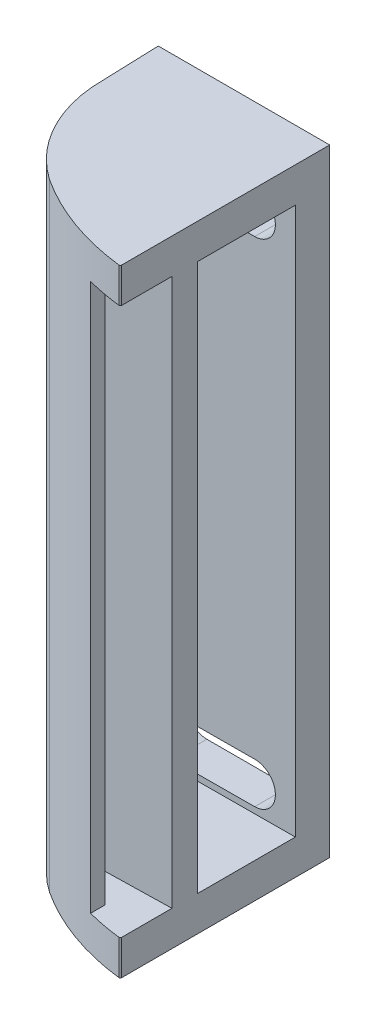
ISO-10303-21;
HEADER;
FILE_DESCRIPTION(('STEP AP214'),'2;1');
FILE_NAME('part.step','',(''),(''),'','','');
FILE_SCHEMA(('AUTOMOTIVE_DESIGN { 1 0 10303 214 1 1 1 1 }'));
ENDSEC;
DATA;
#1=APPLICATION_CONTEXT('core data for automotive mechanical design processes');
#2=APPLICATION_PROTOCOL_DEFINITION('international standard','automotive_design',2000,#1);
#3=PRODUCT_CONTEXT('',#1,'mechanical');
#4=PRODUCT('Part','Part','',(#3));
#5=PRODUCT_RELATED_PRODUCT_CATEGORY('part','',(#4));
#6=PRODUCT_DEFINITION_FORMATION('','',#4);
#7=PRODUCT_DEFINITION_CONTEXT('part definition',#1,'design');
#8=PRODUCT_DEFINITION('design','',#6,#7);
#9=PRODUCT_DEFINITION_SHAPE('','',#8);
#10=(LENGTH_UNIT() NAMED_UNIT(*) SI_UNIT(.MILLI.,.METRE.));
#11=(NAMED_UNIT(*) PLANE_ANGLE_UNIT() SI_UNIT($,.RADIAN.));
#12=(NAMED_UNIT(*) SI_UNIT($,.STERADIAN.) SOLID_ANGLE_UNIT());
#13=UNCERTAINTY_MEASURE_WITH_UNIT(LENGTH_MEASURE(1.E-05),#10,'distance_accuracy_value','');
#14=(GEOMETRIC_REPRESENTATION_CONTEXT(3) GLOBAL_UNCERTAINTY_ASSIGNED_CONTEXT((#13)) GLOBAL_UNIT_ASSIGNED_CONTEXT((#10,
#11,#12)) REPRESENTATION_CONTEXT('',''));
#15=CARTESIAN_POINT('',(0.,0.,0.));
#16=DIRECTION('',(0.,0.,1.));
#17=DIRECTION('',(1.,0.,0.));
#18=AXIS2_PLACEMENT_3D('',#15,#16,#17);
#19=CARTESIAN_POINT('',(-5.301570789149,-9.,5.1214842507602));
#20=DIRECTION('',(0.00523596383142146,0.,0.999986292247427));
#21=DIRECTION('',(0.999986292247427,0.,-0.00523596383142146));
#22=AXIS2_PLACEMENT_3D('',#19,#20,#21);
#23=PLANE('',#22);
#24=CARTESIAN_POINT('',(12.,0.,5.03089261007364));
#25=DIRECTION('',(0.00523596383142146,0.,0.999986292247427));
#26=DIRECTION('',(0.999986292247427,0.,-0.00523596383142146));
#27=AXIS2_PLACEMENT_3D('',#24,#25,#26);
#28=ELLIPSE('',#27,3.00004112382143,3.);
#29=CARTESIAN_POINT('',(12.,3.,5.03089261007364));
#30=VERTEX_POINT('',#29);
#31=CARTESIAN_POINT('',(12.,-3.,5.03089261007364));
#32=VERTEX_POINT('',#31);
#33=EDGE_CURVE('E270',#30,#32,#28,.F.);
#34=ORIENTED_EDGE('',*,*,#33,.T.);
#35=DIRECTION('',(-0.999986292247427,0.,0.00523596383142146));
#36=VECTOR('',#35,1.);
#37=CARTESIAN_POINT('',(-5.301570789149,-3.,5.1214842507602));
#38=LINE('',#37,#36);
#39=CARTESIAN_POINT('',(0.,-3.,5.09372503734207));
#40=VERTEX_POINT('',#39);
#41=EDGE_CURVE('E273',#32,#40,#38,.T.);
#42=ORIENTED_EDGE('',*,*,#41,.T.);
#43=CARTESIAN_POINT('',(0.,0.,5.09372503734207));
#44=DIRECTION('',(0.00523596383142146,0.,0.999986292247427));
#45=DIRECTION('',(0.999986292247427,0.,-0.00523596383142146));
#46=AXIS2_PLACEMENT_3D('',#43,#44,#45);
#47=ELLIPSE('',#46,3.00004112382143,3.);
#48=CARTESIAN_POINT('',(0.,3.,5.09372503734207));
#49=VERTEX_POINT('',#48);
#50=EDGE_CURVE('E264',#40,#49,#47,.F.);
#51=ORIENTED_EDGE('',*,*,#50,.T.);
#52=DIRECTION('',(0.999986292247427,0.,-0.00523596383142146));
#53=VECTOR('',#52,1.);
#54=CARTESIAN_POINT('',(-5.301570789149,3.,5.1214842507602));
#55=LINE('',#54,#53);
#56=EDGE_CURVE('E267',#49,#30,#55,.T.);
#57=ORIENTED_EDGE('',*,*,#56,.T.);
#58=EDGE_LOOP('',(#34,#42,#51,#57));
#59=FACE_BOUND('',#58,.T.);
#60=DIRECTION('',(-0.999986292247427,0.,0.00523596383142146));
#61=VECTOR('',#60,1.);
#62=CARTESIAN_POINT('',(-5.301570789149,-3.9,5.1214842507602));
#63=LINE('',#62,#61);
#64=CARTESIAN_POINT('',(17.9,-3.9,5.));
#65=VERTEX_POINT('',#64);
#66=CARTESIAN_POINT('',(-5.301570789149,-3.9,5.1214842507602));
#67=VERTEX_POINT('',#66);
#68=EDGE_CURVE('E294',#65,#67,#63,.T.);
#69=ORIENTED_EDGE('',*,*,#68,.F.);
#70=DIRECTION('',(0.,1.,0.));
#71=VECTOR('',#70,1.);
#72=CARTESIAN_POINT('',(17.9,-9.,5.));
#73=LINE('',#72,#71);
#74=CARTESIAN_POINT('',(17.9,75.9,5.));
#75=VERTEX_POINT('',#74);
#76=EDGE_CURVE('E401',#65,#75,#73,.T.);
#77=ORIENTED_EDGE('',*,*,#76,.T.);
#78=DIRECTION('',(-0.999986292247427,0.,0.00523596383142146));
#79=VECTOR('',#78,1.);
#80=CARTESIAN_POINT('',(-5.301570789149,75.9,5.1214842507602));
#81=LINE('',#80,#79);
#82=CARTESIAN_POINT('',(-5.301570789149,75.9,5.1214842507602));
#83=VERTEX_POINT('',#82);
#84=EDGE_CURVE('E9',#75,#83,#81,.T.);
#85=ORIENTED_EDGE('',*,*,#84,.T.);
#86=DIRECTION('',(0.,1.,0.));
#87=VECTOR('',#86,1.);
#88=CARTESIAN_POINT('',(-5.301570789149,-9.,5.1214842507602));
#89=LINE('',#88,#87);
#90=EDGE_CURVE('E403',#67,#83,#89,.T.);
#91=ORIENTED_EDGE('',*,*,#90,.F.);
#92=EDGE_LOOP('',(#69,#77,#85,#91));
#93=FACE_BOUND('',#92,.T.);
#94=CARTESIAN_POINT('',(12.,72.,5.03089261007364));
#95=DIRECTION('',(0.00523596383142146,0.,0.999986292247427));
#96=DIRECTION('',(0.999986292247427,0.,-0.00523596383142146));
#97=AXIS2_PLACEMENT_3D('',#94,#95,#96);
#98=ELLIPSE('',#97,3.00004112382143,3.);
#99=CARTESIAN_POINT('',(12.,75.,5.03089261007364));
#100=VERTEX_POINT('',#99);
#101=CARTESIAN_POINT('',(12.,69.,5.03089261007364));
#102=VERTEX_POINT('',#101);
#103=EDGE_CURVE('E237',#100,#102,#98,.F.);
#104=ORIENTED_EDGE('',*,*,#103,.T.);
#105=DIRECTION('',(-0.999986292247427,0.,0.00523596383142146));
#106=VECTOR('',#105,1.);
#107=CARTESIAN_POINT('',(-5.301570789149,69.,5.1214842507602));
#108=LINE('',#107,#106);
#109=CARTESIAN_POINT('',(0.,69.,5.09372503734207));
#110=VERTEX_POINT('',#109);
#111=EDGE_CURVE('E202',#102,#110,#108,.T.);
#112=ORIENTED_EDGE('',*,*,#111,.T.);
#113=CARTESIAN_POINT('',(0.,72.,5.09372503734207));
#114=DIRECTION('',(0.00523596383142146,0.,0.999986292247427));
#115=DIRECTION('',(0.999986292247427,0.,-0.00523596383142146));
#116=AXIS2_PLACEMENT_3D('',#113,#114,#115);
#117=ELLIPSE('',#116,3.00004112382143,3.);
#118=CARTESIAN_POINT('',(0.,75.,5.09372503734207));
#119=VERTEX_POINT('',#118);
#120=EDGE_CURVE('E205',#110,#119,#117,.F.);
#121=ORIENTED_EDGE('',*,*,#120,.T.);
#122=DIRECTION('',(0.999986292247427,0.,-0.00523596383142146));
#123=VECTOR('',#122,1.);
#124=CARTESIAN_POINT('',(-5.301570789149,75.,5.1214842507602));
#125=LINE('',#124,#123);
#126=EDGE_CURVE('E234',#119,#100,#125,.T.);
#127=ORIENTED_EDGE('',*,*,#126,.T.);
#128=EDGE_LOOP('',(#104,#112,#121,#127));
#129=FACE_BOUND('',#128,.T.);
#130=ADVANCED_FACE('F14',(#59,#93,#129),#23,.T.);
#131=CARTESIAN_POINT('',(17.9,-9.,0.));
#132=DIRECTION('',(0.,0.,-1.));
#133=DIRECTION('',(0.,-1.,0.));
#134=AXIS2_PLACEMENT_3D('',#131,#132,#133);
#135=PLANE('',#134);
#136=CARTESIAN_POINT('',(0.,0.,0.));
#137=DIRECTION('',(0.,0.,1.));
#138=DIRECTION('',(1.,0.,0.));
#139=AXIS2_PLACEMENT_3D('',#136,#137,#138);
#140=CIRCLE('',#139,3.);
#141=CARTESIAN_POINT('',(0.,3.,0.));
#142=VERTEX_POINT('',#141);
#143=CARTESIAN_POINT('',(0.,-3.,0.));
#144=VERTEX_POINT('',#143);
#145=EDGE_CURVE('E249',#142,#144,#140,.T.);
#146=ORIENTED_EDGE('',*,*,#145,.T.);
#147=DIRECTION('',(1.,0.,0.));
#148=VECTOR('',#147,1.);
#149=CARTESIAN_POINT('',(0.,-3.,0.));
#150=LINE('',#149,#148);
#151=CARTESIAN_POINT('',(12.,-3.,0.));
#152=VERTEX_POINT('',#151);
#153=EDGE_CURVE('E240',#144,#152,#150,.T.);
#154=ORIENTED_EDGE('',*,*,#153,.T.);
#155=CARTESIAN_POINT('',(12.,0.,0.));
#156=DIRECTION('',(0.,0.,1.));
#157=DIRECTION('',(-1.,0.,0.));
#158=AXIS2_PLACEMENT_3D('',#155,#156,#157);
#159=CIRCLE('',#158,3.);
#160=CARTESIAN_POINT('',(12.,3.,0.));
#161=VERTEX_POINT('',#160);
#162=EDGE_CURVE('E241',#152,#161,#159,.T.);
#163=ORIENTED_EDGE('',*,*,#162,.T.);
#164=DIRECTION('',(-1.,0.,0.));
#165=VECTOR('',#164,1.);
#166=CARTESIAN_POINT('',(12.,3.,0.));
#167=LINE('',#166,#165);
#168=EDGE_CURVE('E245',#161,#142,#167,.T.);
#169=ORIENTED_EDGE('',*,*,#168,.T.);
#170=EDGE_LOOP('',(#146,#154,#163,#169));
#171=FACE_BOUND('',#170,.T.);
#172=DIRECTION('',(-1.,0.,0.));
#173=VECTOR('',#172,1.);
#174=CARTESIAN_POINT('',(17.9,81.,0.));
#175=LINE('',#174,#173);
#176=CARTESIAN_POINT('',(17.9,81.,0.));
#177=VERTEX_POINT('',#176);
#178=CARTESIAN_POINT('',(-7.090890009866,81.,0.));
#179=VERTEX_POINT('',#178);
#180=EDGE_CURVE('E371',#177,#179,#175,.T.);
#181=ORIENTED_EDGE('',*,*,#180,.F.);
#182=DIRECTION('',(0.,1.,0.));
#183=VECTOR('',#182,1.);
#184=CARTESIAN_POINT('',(17.9,-9.,0.));
#185=LINE('',#184,#183);
#186=CARTESIAN_POINT('',(17.9,-9.,0.));
#187=VERTEX_POINT('',#186);
#188=EDGE_CURVE('E22',#187,#177,#185,.T.);
#189=ORIENTED_EDGE('',*,*,#188,.F.);
#190=DIRECTION('',(-1.,0.,0.));
#191=VECTOR('',#190,1.);
#192=CARTESIAN_POINT('',(17.9,-9.,0.));
#193=LINE('',#192,#191);
#194=CARTESIAN_POINT('',(-7.090890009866,-9.,0.));
#195=VERTEX_POINT('',#194);
#196=EDGE_CURVE('E383',#187,#195,#193,.T.);
#197=ORIENTED_EDGE('',*,*,#196,.T.);
#198=DIRECTION('',(0.,1.,0.));
#199=VECTOR('',#198,1.);
#200=CARTESIAN_POINT('',(-7.090890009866,-9.,0.));
#201=LINE('',#200,#199);
#202=EDGE_CURVE('E429',#195,#179,#201,.T.);
#203=ORIENTED_EDGE('',*,*,#202,.T.);
#204=EDGE_LOOP('',(#181,#189,#197,#203));
#205=FACE_BOUND('',#204,.T.);
#206=CARTESIAN_POINT('',(0.,72.,0.));
#207=DIRECTION('',(0.,0.,1.));
#208=DIRECTION('',(1.,0.,0.));
#209=AXIS2_PLACEMENT_3D('',#206,#207,#208);
#210=CIRCLE('',#209,3.);
#211=CARTESIAN_POINT('',(0.,75.,0.));
#212=VERTEX_POINT('',#211);
#213=CARTESIAN_POINT('',(0.,69.,0.));
#214=VERTEX_POINT('',#213);
#215=EDGE_CURVE('E219',#212,#214,#210,.T.);
#216=ORIENTED_EDGE('',*,*,#215,.T.);
#217=DIRECTION('',(1.,0.,0.));
#218=VECTOR('',#217,1.);
#219=CARTESIAN_POINT('',(0.,69.,0.));
#220=LINE('',#219,#218);
#221=CARTESIAN_POINT('',(12.,69.,0.));
#222=VERTEX_POINT('',#221);
#223=EDGE_CURVE('E37',#214,#222,#220,.T.);
#224=ORIENTED_EDGE('',*,*,#223,.T.);
#225=CARTESIAN_POINT('',(12.,72.,0.));
#226=DIRECTION('',(0.,0.,1.));
#227=DIRECTION('',(-1.,0.,0.));
#228=AXIS2_PLACEMENT_3D('',#225,#226,#227);
#229=CIRCLE('',#228,3.);
#230=CARTESIAN_POINT('',(12.,75.,0.));
#231=VERTEX_POINT('',#230);
#232=EDGE_CURVE('E209',#222,#231,#229,.T.);
#233=ORIENTED_EDGE('',*,*,#232,.T.);
#234=DIRECTION('',(-1.,0.,0.));
#235=VECTOR('',#234,1.);
#236=CARTESIAN_POINT('',(12.,75.,0.));
#237=LINE('',#236,#235);
#238=EDGE_CURVE('E216',#231,#212,#237,.T.);
#239=ORIENTED_EDGE('',*,*,#238,.T.);
#240=EDGE_LOOP('',(#216,#224,#233,#239));
#241=FACE_BOUND('',#240,.T.);
#242=ADVANCED_FACE('F16',(#171,#205,#241),#135,.T.);
#243=CARTESIAN_POINT('',(12.6,-9.,29.566596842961));
#244=DIRECTION('',(1.,0.,0.));
#245=DIRECTION('',(0.,1.,0.));
#246=AXIS2_PLACEMENT_3D('',#243,#244,#245);
#247=PLANE('',#246);
#248=DIRECTION('',(0.,0.,1.));
#249=VECTOR('',#248,1.);
#250=CARTESIAN_POINT('',(12.6,-3.9,29.566596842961));
#251=LINE('',#250,#249);
#252=CARTESIAN_POINT('',(12.6,-3.9,27.495073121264));
#253=VERTEX_POINT('',#252);
#254=CARTESIAN_POINT('',(12.6,-3.9,29.566596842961));
#255=VERTEX_POINT('',#254);
#256=EDGE_CURVE('E321',#253,#255,#251,.T.);
#257=ORIENTED_EDGE('',*,*,#256,.F.);
#258=DIRECTION('',(0.,1.,0.));
#259=VECTOR('',#258,1.);
#260=CARTESIAN_POINT('',(12.6,-9.,27.495073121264));
#261=LINE('',#260,#259);
#262=CARTESIAN_POINT('',(12.6,75.9,27.495073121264));
#263=VERTEX_POINT('',#262);
#264=EDGE_CURVE('E421',#253,#263,#261,.T.);
#265=ORIENTED_EDGE('',*,*,#264,.T.);
#266=DIRECTION('',(0.,0.,1.));
#267=VECTOR('',#266,1.);
#268=CARTESIAN_POINT('',(12.6,75.9,29.566596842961));
#269=LINE('',#268,#267);
#270=CARTESIAN_POINT('',(12.6,75.9,29.5665968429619));
#271=VERTEX_POINT('',#270);
#272=EDGE_CURVE('E367',#263,#271,#269,.T.);
#273=ORIENTED_EDGE('',*,*,#272,.T.);
#274=DIRECTION('',(0.,1.,0.));
#275=VECTOR('',#274,1.);
#276=CARTESIAN_POINT('',(12.6,-9.,29.566596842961));
#277=LINE('',#276,#275);
#278=EDGE_CURVE('E423',#255,#271,#277,.T.);
#279=ORIENTED_EDGE('',*,*,#278,.F.);
#280=EDGE_LOOP('',(#257,#265,#273,#279));
#281=FACE_BOUND('',#280,.T.);
#282=ADVANCED_FACE('F479',(#281),#247,.T.);
#283=CARTESIAN_POINT('',(21.8699999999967,-9.,-5.83999999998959));
#284=DIRECTION('',(0.,1.,0.));
#285=DIRECTION('',(-1.,0.,0.));
#286=AXIS2_PLACEMENT_3D('',#283,#284,#285);
#287=CYLINDRICAL_SURFACE('',#286,34.5999999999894);
#288=CARTESIAN_POINT('',(21.8699999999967,-3.9,-5.83999999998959));
#289=DIRECTION('',(0.,1.,0.));
#290=DIRECTION('',(-1.,0.,0.));
#291=AXIS2_PLACEMENT_3D('',#288,#289,#290);
#292=CIRCLE('',#291,34.5999999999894);
#293=CARTESIAN_POINT('',(3.245597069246,-3.9,23.319760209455));
#294=VERTEX_POINT('',#293);
#295=EDGE_CURVE('E318',#294,#253,#292,.T.);
#296=ORIENTED_EDGE('',*,*,#295,.F.);
#297=DIRECTION('',(0.,1.,0.));
#298=VECTOR('',#297,1.);
#299=CARTESIAN_POINT('',(3.245597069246,-9.,23.319760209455));
#300=LINE('',#299,#298);
#301=CARTESIAN_POINT('',(3.245597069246,75.9,23.319760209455));
#302=VERTEX_POINT('',#301);
#303=EDGE_CURVE('E419',#294,#302,#300,.T.);
#304=ORIENTED_EDGE('',*,*,#303,.T.);
#305=CARTESIAN_POINT('',(21.8699999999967,75.9,-5.83999999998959));
#306=DIRECTION('',(0.,1.,0.));
#307=DIRECTION('',(-1.,0.,0.));
#308=AXIS2_PLACEMENT_3D('',#305,#306,#307);
#309=CIRCLE('',#308,34.5999999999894);
#310=EDGE_CURVE('E364',#302,#263,#309,.T.);
#311=ORIENTED_EDGE('',*,*,#310,.T.);
#312=ORIENTED_EDGE('',*,*,#264,.F.);
#313=EDGE_LOOP('',(#296,#304,#311,#312));
#314=FACE_BOUND('',#313,.T.);
#315=ADVANCED_FACE('F482',(#314),#287,.F.);
#316=CARTESIAN_POINT('',(3.245597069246,-9.,23.319760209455));
#317=DIRECTION('',(0.0218148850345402,0.,0.999762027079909));
#318=DIRECTION('',(0.99976202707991,0.,-0.0218148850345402));
#319=AXIS2_PLACEMENT_3D('',#316,#317,#318);
#320=PLANE('',#319);
#321=DIRECTION('',(-0.99976202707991,0.,0.0218148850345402));
#322=VECTOR('',#321,1.);
#323=CARTESIAN_POINT('',(3.245597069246,-3.9,23.319760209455));
#324=LINE('',#323,#322);
#325=CARTESIAN_POINT('',(17.9,-3.9,23.));
#326=VERTEX_POINT('',#325);
#327=EDGE_CURVE('E315',#326,#294,#324,.T.);
#328=ORIENTED_EDGE('',*,*,#327,.F.);
#329=DIRECTION('',(0.,1.,0.));
#330=VECTOR('',#329,1.);
#331=CARTESIAN_POINT('',(17.9,-9.,23.));
#332=LINE('',#331,#330);
#333=CARTESIAN_POINT('',(17.9,75.9,23.));
#334=VERTEX_POINT('',#333);
#335=EDGE_CURVE('E417',#326,#334,#332,.T.);
#336=ORIENTED_EDGE('',*,*,#335,.T.);
#337=DIRECTION('',(-0.99976202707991,0.,0.0218148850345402));
#338=VECTOR('',#337,1.);
#339=CARTESIAN_POINT('',(3.245597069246,75.9,23.319760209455));
#340=LINE('',#339,#338);
#341=EDGE_CURVE('E361',#334,#302,#340,.T.);
#342=ORIENTED_EDGE('',*,*,#341,.T.);
#343=ORIENTED_EDGE('',*,*,#303,.F.);
#344=EDGE_LOOP('',(#328,#336,#342,#343));
#345=FACE_BOUND('',#344,.T.);
#346=ADVANCED_FACE('F456',(#345),#320,.T.);
#347=CARTESIAN_POINT('',(17.9,-9.,19.26));
#348=DIRECTION('',(0.0218148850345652,0.,-0.999762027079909));
#349=DIRECTION('',(-0.999762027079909,0.,-0.0218148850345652));
#350=AXIS2_PLACEMENT_3D('',#347,#348,#349);
#351=PLANE('',#350);
#352=DIRECTION('',(0.999762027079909,0.,0.0218148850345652));
#353=VECTOR('',#352,1.);
#354=CARTESIAN_POINT('',(17.9,-3.9,19.26));
#355=LINE('',#354,#353);
#356=CARTESIAN_POINT('',(-0.491468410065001,-3.9,18.858696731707));
#357=VERTEX_POINT('',#356);
#358=CARTESIAN_POINT('',(17.9,-3.9,19.26));
#359=VERTEX_POINT('',#358);
#360=EDGE_CURVE('E312',#357,#359,#355,.T.);
#361=ORIENTED_EDGE('',*,*,#360,.F.);
#362=DIRECTION('',(0.,1.,0.));
#363=VECTOR('',#362,1.);
#364=CARTESIAN_POINT('',(-0.491468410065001,-9.,18.858696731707));
#365=LINE('',#364,#363);
#366=CARTESIAN_POINT('',(-0.491468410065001,75.9,18.858696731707));
#367=VERTEX_POINT('',#366);
#368=EDGE_CURVE('E413',#357,#367,#365,.T.);
#369=ORIENTED_EDGE('',*,*,#368,.T.);
#370=DIRECTION('',(0.999762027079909,0.,0.0218148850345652));
#371=VECTOR('',#370,1.);
#372=CARTESIAN_POINT('',(17.9,75.9,19.26));
#373=LINE('',#372,#371);
#374=CARTESIAN_POINT('',(17.9,75.9,19.26));
#375=VERTEX_POINT('',#374);
#376=EDGE_CURVE('E358',#367,#375,#373,.T.);
#377=ORIENTED_EDGE('',*,*,#376,.T.);
#378=DIRECTION('',(0.,1.,0.));
#379=VECTOR('',#378,1.);
#380=CARTESIAN_POINT('',(17.9,-9.,19.26));
#381=LINE('',#380,#379);
#382=EDGE_CURVE('E415',#359,#375,#381,.T.);
#383=ORIENTED_EDGE('',*,*,#382,.F.);
#384=EDGE_LOOP('',(#361,#369,#377,#383));
#385=FACE_BOUND('',#384,.T.);
#386=ADVANCED_FACE('F491',(#385),#351,.T.);
#387=CARTESIAN_POINT('',(12.6000000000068,-9.,8.32999999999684));
#388=DIRECTION('',(0.,1.,0.));
#389=DIRECTION('',(-1.,0.,0.));
#390=AXIS2_PLACEMENT_3D('',#387,#388,#389);
#391=CYLINDRICAL_SURFACE('',#390,16.8000000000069);
#392=CARTESIAN_POINT('',(12.6000000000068,-3.9,8.32999999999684));
#393=DIRECTION('',(0.,1.,0.));
#394=DIRECTION('',(-1.,0.,0.));
#395=AXIS2_PLACEMENT_3D('',#392,#393,#394);
#396=CIRCLE('',#395,16.8000000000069);
#397=CARTESIAN_POINT('',(-3.70947883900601,-3.9,12.36));
#398=VERTEX_POINT('',#397);
#399=EDGE_CURVE('E309',#398,#357,#396,.T.);
#400=ORIENTED_EDGE('',*,*,#399,.F.);
#401=DIRECTION('',(0.,1.,0.));
#402=VECTOR('',#401,1.);
#403=CARTESIAN_POINT('',(-3.70947883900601,-9.,12.36));
#404=LINE('',#403,#402);
#405=CARTESIAN_POINT('',(-3.70947883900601,75.9,12.36));
#406=VERTEX_POINT('',#405);
#407=EDGE_CURVE('E411',#398,#406,#404,.T.);
#408=ORIENTED_EDGE('',*,*,#407,.T.);
#409=CARTESIAN_POINT('',(12.6000000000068,75.9,8.32999999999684));
#410=DIRECTION('',(0.,1.,0.));
#411=DIRECTION('',(-1.,0.,0.));
#412=AXIS2_PLACEMENT_3D('',#409,#410,#411);
#413=CIRCLE('',#412,16.8000000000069);
#414=EDGE_CURVE('E355',#406,#367,#413,.T.);
#415=ORIENTED_EDGE('',*,*,#414,.T.);
#416=ORIENTED_EDGE('',*,*,#368,.F.);
#417=EDGE_LOOP('',(#400,#408,#415,#416));
#418=FACE_BOUND('',#417,.T.);
#419=ADVANCED_FACE('F521',(#418),#391,.F.);
#420=CARTESIAN_POINT('',(-3.70947883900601,-9.,12.36));
#421=DIRECTION('',(0.,0.,-1.));
#422=DIRECTION('',(0.,-1.,0.));
#423=AXIS2_PLACEMENT_3D('',#420,#421,#422);
#424=PLANE('',#423);
#425=DIRECTION('',(1.,0.,0.));
#426=VECTOR('',#425,1.);
#427=CARTESIAN_POINT('',(-3.70947883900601,-3.9,12.36));
#428=LINE('',#427,#426);
#429=CARTESIAN_POINT('',(-5.3,-3.9,12.36));
#430=VERTEX_POINT('',#429);
#431=EDGE_CURVE('E306',#430,#398,#428,.T.);
#432=ORIENTED_EDGE('',*,*,#431,.F.);
#433=DIRECTION('',(0.,1.,0.));
#434=VECTOR('',#433,1.);
#435=CARTESIAN_POINT('',(-5.3,-9.,12.36));
#436=LINE('',#435,#434);
#437=CARTESIAN_POINT('',(-5.3,75.9,12.36));
#438=VERTEX_POINT('',#437);
#439=EDGE_CURVE('E409',#430,#438,#436,.T.);
#440=ORIENTED_EDGE('',*,*,#439,.T.);
#441=DIRECTION('',(1.,0.,0.));
#442=VECTOR('',#441,1.);
#443=CARTESIAN_POINT('',(-3.70947883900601,75.9,12.36));
#444=LINE('',#443,#442);
#445=EDGE_CURVE('E352',#438,#406,#444,.T.);
#446=ORIENTED_EDGE('',*,*,#445,.T.);
#447=ORIENTED_EDGE('',*,*,#407,.F.);
#448=EDGE_LOOP('',(#432,#440,#446,#447));
#449=FACE_BOUND('',#448,.T.);
#450=ADVANCED_FACE('F517',(#449),#424,.T.);
#451=CARTESIAN_POINT('',(-5.3,-9.,12.0600000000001));
#452=DIRECTION('',(0.,1.,0.));
#453=DIRECTION('',(-1.,0.,0.));
#454=AXIS2_PLACEMENT_3D('',#451,#452,#453);
#455=CYLINDRICAL_SURFACE('',#454,0.299999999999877);
#456=CARTESIAN_POINT('',(-5.3,-3.9,12.0600000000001));
#457=DIRECTION('',(0.,1.,0.));
#458=DIRECTION('',(-1.,0.,0.));
#459=AXIS2_PLACEMENT_3D('',#456,#457,#458);
#460=CIRCLE('',#459,0.299999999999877);
#461=CARTESIAN_POINT('',(-5.6,-3.9,12.06));
#462=VERTEX_POINT('',#461);
#463=EDGE_CURVE('E303',#462,#430,#460,.T.);
#464=ORIENTED_EDGE('',*,*,#463,.F.);
#465=DIRECTION('',(0.,1.,0.));
#466=VECTOR('',#465,1.);
#467=CARTESIAN_POINT('',(-5.6,-9.,12.06));
#468=LINE('',#467,#466);
#469=CARTESIAN_POINT('',(-5.6,75.9,12.06));
#470=VERTEX_POINT('',#469);
#471=EDGE_CURVE('E407',#462,#470,#468,.T.);
#472=ORIENTED_EDGE('',*,*,#471,.T.);
#473=CARTESIAN_POINT('',(-5.3,75.9,12.0600000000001));
#474=DIRECTION('',(0.,1.,0.));
#475=DIRECTION('',(-1.,0.,0.));
#476=AXIS2_PLACEMENT_3D('',#473,#474,#475);
#477=CIRCLE('',#476,0.299999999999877);
#478=EDGE_CURVE('E349',#470,#438,#477,.T.);
#479=ORIENTED_EDGE('',*,*,#478,.T.);
#480=ORIENTED_EDGE('',*,*,#439,.F.);
#481=EDGE_LOOP('',(#464,#472,#479,#480));
#482=FACE_BOUND('',#481,.T.);
#483=ADVANCED_FACE('F513',(#482),#455,.F.);
#484=CARTESIAN_POINT('',(-5.6,-9.,12.06));
#485=DIRECTION('',(1.,0.,0.));
#486=DIRECTION('',(0.,1.,0.));
#487=AXIS2_PLACEMENT_3D('',#484,#485,#486);
#488=PLANE('',#487);
#489=DIRECTION('',(0.,0.,1.));
#490=VECTOR('',#489,1.);
#491=CARTESIAN_POINT('',(-5.6,-3.9,12.06));
#492=LINE('',#491,#490);
#493=CARTESIAN_POINT('',(-5.6,-3.9,5.4214801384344));
#494=VERTEX_POINT('',#493);
#495=EDGE_CURVE('E300',#494,#462,#492,.T.);
#496=ORIENTED_EDGE('',*,*,#495,.F.);
#497=DIRECTION('',(0.,1.,0.));
#498=VECTOR('',#497,1.);
#499=CARTESIAN_POINT('',(-5.6,-9.,5.4214801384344));
#500=LINE('',#499,#498);
#501=CARTESIAN_POINT('',(-5.6,75.9,5.42148013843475));
#502=VERTEX_POINT('',#501);
#503=EDGE_CURVE('E405',#494,#502,#500,.T.);
#504=ORIENTED_EDGE('',*,*,#503,.T.);
#505=DIRECTION('',(0.,0.,1.));
#506=VECTOR('',#505,1.);
#507=CARTESIAN_POINT('',(-5.6,75.9,12.06));
#508=LINE('',#507,#506);
#509=EDGE_CURVE('E346',#502,#470,#508,.T.);
#510=ORIENTED_EDGE('',*,*,#509,.T.);
#511=ORIENTED_EDGE('',*,*,#471,.F.);
#512=EDGE_LOOP('',(#496,#504,#510,#511));
#513=FACE_BOUND('',#512,.T.);
#514=ADVANCED_FACE('F509',(#513),#488,.T.);
#515=CARTESIAN_POINT('',(-5.2999999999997,-9.,5.42148013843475));
#516=DIRECTION('',(0.,1.,0.));
#517=DIRECTION('',(-1.,0.,0.));
#518=AXIS2_PLACEMENT_3D('',#515,#516,#517);
#519=CYLINDRICAL_SURFACE('',#518,0.300000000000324);
#520=CARTESIAN_POINT('',(-5.2999999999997,-3.9,5.42148013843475));
#521=DIRECTION('',(0.,1.,0.));
#522=DIRECTION('',(-1.,0.,0.));
#523=AXIS2_PLACEMENT_3D('',#520,#521,#522);
#524=CIRCLE('',#523,0.300000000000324);
#525=EDGE_CURVE('E297',#67,#494,#524,.T.);
#526=ORIENTED_EDGE('',*,*,#525,.F.);
#527=ORIENTED_EDGE('',*,*,#90,.T.);
#528=CARTESIAN_POINT('',(-5.2999999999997,75.9,5.42148013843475));
#529=DIRECTION('',(0.,1.,0.));
#530=DIRECTION('',(-1.,0.,0.));
#531=AXIS2_PLACEMENT_3D('',#528,#529,#530);
#532=CIRCLE('',#531,0.300000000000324);
#533=EDGE_CURVE('E343',#83,#502,#532,.T.);
#534=ORIENTED_EDGE('',*,*,#533,.T.);
#535=ORIENTED_EDGE('',*,*,#503,.F.);
#536=EDGE_LOOP('',(#526,#527,#534,#535));
#537=FACE_BOUND('',#536,.T.);
#538=ADVANCED_FACE('F506',(#537),#519,.F.);
#539=CARTESIAN_POINT('',(-7.090890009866,-9.,0.));
#540=DIRECTION('',(-0.999390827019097,0.,0.0348994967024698));
#541=DIRECTION('',(0.0348994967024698,0.,0.999390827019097));
#542=AXIS2_PLACEMENT_3D('',#539,#540,#541);
#543=PLANE('',#542);
#544=DIRECTION('',(0.0348994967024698,0.,0.999390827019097));
#545=VECTOR('',#544,1.);
#546=CARTESIAN_POINT('',(-7.090890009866,81.,0.));
#547=LINE('',#546,#545);
#548=CARTESIAN_POINT('',(-6.8,81.,8.3300000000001));
#549=VERTEX_POINT('',#548);
#550=EDGE_CURVE('E374',#179,#549,#547,.T.);
#551=ORIENTED_EDGE('',*,*,#550,.F.);
#552=ORIENTED_EDGE('',*,*,#202,.F.);
#553=DIRECTION('',(0.0348994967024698,0.,0.999390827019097));
#554=VECTOR('',#553,1.);
#555=CARTESIAN_POINT('',(-7.090890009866,-9.,0.));
#556=LINE('',#555,#554);
#557=CARTESIAN_POINT('',(-6.8,-9.,8.3300000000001));
#558=VERTEX_POINT('',#557);
#559=EDGE_CURVE('E389',#195,#558,#556,.T.);
#560=ORIENTED_EDGE('',*,*,#559,.T.);
#561=DIRECTION('',(0.,1.,0.));
#562=VECTOR('',#561,1.);
#563=CARTESIAN_POINT('',(-6.8,-9.,8.3300000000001));
#564=LINE('',#563,#562);
#565=EDGE_CURVE('E427',#558,#549,#564,.T.);
#566=ORIENTED_EDGE('',*,*,#565,.T.);
#567=EDGE_LOOP('',(#551,#552,#560,#566));
#568=FACE_BOUND('',#567,.T.);
#569=ADVANCED_FACE('F471',(#568),#543,.T.);
#570=CARTESIAN_POINT('',(13.2000000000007,-9.,8.32999999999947));
#571=DIRECTION('',(0.,1.,0.));
#572=DIRECTION('',(-1.,0.,0.));
#573=AXIS2_PLACEMENT_3D('',#570,#571,#572);
#574=CYLINDRICAL_SURFACE('',#573,20.0000000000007);
#575=CARTESIAN_POINT('',(13.2000000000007,81.,8.32999999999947));
#576=DIRECTION('',(0.,1.,0.));
#577=DIRECTION('',(-1.,0.,0.));
#578=AXIS2_PLACEMENT_3D('',#575,#576,#577);
#579=CIRCLE('',#578,20.0000000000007);
#580=CARTESIAN_POINT('',(1.89935933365,81.,24.831379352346));
#581=VERTEX_POINT('',#580);
#582=EDGE_CURVE('E377',#549,#581,#579,.T.);
#583=ORIENTED_EDGE('',*,*,#582,.F.);
#584=ORIENTED_EDGE('',*,*,#565,.F.);
#585=CARTESIAN_POINT('',(13.2000000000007,-9.,8.32999999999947));
#586=DIRECTION('',(0.,1.,0.));
#587=DIRECTION('',(-1.,0.,0.));
#588=AXIS2_PLACEMENT_3D('',#585,#586,#587);
#589=CIRCLE('',#588,20.0000000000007);
#590=CARTESIAN_POINT('',(1.89935933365,-9.,24.831379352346));
#591=VERTEX_POINT('',#590);
#592=EDGE_CURVE('E392',#558,#591,#589,.T.);
#593=ORIENTED_EDGE('',*,*,#592,.T.);
#594=DIRECTION('',(0.,1.,0.));
#595=VECTOR('',#594,1.);
#596=CARTESIAN_POINT('',(1.89935933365,-9.,24.831379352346));
#597=LINE('',#596,#595);
#598=EDGE_CURVE('E425',#591,#581,#597,.T.);
#599=ORIENTED_EDGE('',*,*,#598,.T.);
#600=EDGE_LOOP('',(#583,#584,#593,#599));
#601=FACE_BOUND('',#600,.T.);
#602=ADVANCED_FACE('F474',(#601),#574,.T.);
#603=CARTESIAN_POINT('',(21.8699999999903,-9.,-5.83999999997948));
#604=DIRECTION('',(0.,1.,0.));
#605=DIRECTION('',(-1.,0.,0.));
#606=AXIS2_PLACEMENT_3D('',#603,#604,#605);
#607=CYLINDRICAL_SURFACE('',#606,36.5999999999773);
#608=CARTESIAN_POINT('',(21.8699999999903,81.,-5.83999999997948));
#609=DIRECTION('',(0.,1.,0.));
#610=DIRECTION('',(-1.,0.,0.));
#611=AXIS2_PLACEMENT_3D('',#608,#609,#610);
#612=CIRCLE('',#611,36.5999999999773);
#613=CARTESIAN_POINT('',(17.6770879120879,81.,30.519035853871));
#614=VERTEX_POINT('',#613);
#615=EDGE_CURVE('E380',#581,#614,#612,.T.);
#616=ORIENTED_EDGE('',*,*,#615,.F.);
#617=ORIENTED_EDGE('',*,*,#598,.F.);
#618=CARTESIAN_POINT('',(21.8699999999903,-9.,-5.83999999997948));
#619=DIRECTION('',(0.,1.,0.));
#620=DIRECTION('',(-1.,0.,0.));
#621=AXIS2_PLACEMENT_3D('',#618,#619,#620);
#622=CIRCLE('',#621,36.5999999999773);
#623=CARTESIAN_POINT('',(17.6770879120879,-9.,30.519035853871));
#624=VERTEX_POINT('',#623);
#625=EDGE_CURVE('E395',#591,#624,#622,.T.);
#626=ORIENTED_EDGE('',*,*,#625,.T.);
#627=DIRECTION('',(0.,-1.,0.));
#628=VECTOR('',#627,1.);
#629=CARTESIAN_POINT('',(17.6770879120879,-3.9,30.519035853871));
#630=LINE('',#629,#628);
#631=CARTESIAN_POINT('',(17.6770879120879,-3.9,30.519035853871));
#632=VERTEX_POINT('',#631);
#633=EDGE_CURVE('E291',#632,#624,#630,.T.);
#634=ORIENTED_EDGE('',*,*,#633,.F.);
#635=CARTESIAN_POINT('',(21.8699999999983,-3.9,-5.83999999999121));
#636=DIRECTION('',(0.,1.,0.));
#637=DIRECTION('',(-1.,0.,0.));
#638=AXIS2_PLACEMENT_3D('',#635,#636,#637);
#639=CIRCLE('',#638,36.5999999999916);
#640=EDGE_CURVE('E281',#255,#632,#639,.T.);
#641=ORIENTED_EDGE('',*,*,#640,.F.);
#642=ORIENTED_EDGE('',*,*,#278,.T.);
#643=CARTESIAN_POINT('',(21.8699999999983,75.9,-5.83999999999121));
#644=DIRECTION('',(0.,1.,0.));
#645=DIRECTION('',(-1.,0.,0.));
#646=AXIS2_PLACEMENT_3D('',#643,#644,#645);
#647=CIRCLE('',#646,36.5999999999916);
#648=CARTESIAN_POINT('',(17.6770879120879,75.9,30.519035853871));
#649=VERTEX_POINT('',#648);
#650=EDGE_CURVE('E329',#271,#649,#647,.T.);
#651=ORIENTED_EDGE('',*,*,#650,.T.);
#652=DIRECTION('',(0.,1.,0.));
#653=VECTOR('',#652,1.);
#654=CARTESIAN_POINT('',(17.6770879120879,75.9,30.519035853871));
#655=LINE('',#654,#653);
#656=EDGE_CURVE('E340',#649,#614,#655,.T.);
#657=ORIENTED_EDGE('',*,*,#656,.T.);
#658=EDGE_LOOP('',(#616,#617,#626,#634,#641,#642,#651,#657));
#659=FACE_BOUND('',#658,.T.);
#660=ADVANCED_FACE('F476',(#659),#607,.T.);
#661=CARTESIAN_POINT('',(17.9,-9.,23.));
#662=DIRECTION('',(1.,0.,0.));
#663=DIRECTION('',(0.,1.,0.));
#664=AXIS2_PLACEMENT_3D('',#661,#662,#663);
#665=PLANE('',#664);
#666=DIRECTION('',(0.,0.,-1.));
#667=VECTOR('',#666,1.);
#668=CARTESIAN_POINT('',(17.9,-3.9,30.320352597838));
#669=LINE('',#668,#667);
#670=EDGE_CURVE('E280',#359,#65,#669,.T.);
#671=ORIENTED_EDGE('',*,*,#670,.F.);
#672=ORIENTED_EDGE('',*,*,#382,.T.);
#673=DIRECTION('',(0.,0.,-1.));
#674=VECTOR('',#673,1.);
#675=CARTESIAN_POINT('',(17.9,75.9,30.320352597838));
#676=LINE('',#675,#674);
#677=EDGE_CURVE('E328',#375,#75,#676,.T.);
#678=ORIENTED_EDGE('',*,*,#677,.T.);
#679=ORIENTED_EDGE('',*,*,#76,.F.);
#680=EDGE_LOOP('',(#671,#672,#678,#679));
#681=FACE_BOUND('',#680,.T.);
#682=DIRECTION('',(0.,0.,-1.));
#683=VECTOR('',#682,1.);
#684=CARTESIAN_POINT('',(17.9,-9.,23.));
#685=LINE('',#684,#683);
#686=CARTESIAN_POINT('',(17.9,-9.,30.320352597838));
#687=VERTEX_POINT('',#686);
#688=EDGE_CURVE('E398',#687,#187,#685,.T.);
#689=ORIENTED_EDGE('',*,*,#688,.T.);
#690=ORIENTED_EDGE('',*,*,#188,.T.);
#691=DIRECTION('',(0.,0.,-1.));
#692=VECTOR('',#691,1.);
#693=CARTESIAN_POINT('',(17.9,81.,5.));
#694=LINE('',#693,#692);
#695=CARTESIAN_POINT('',(17.9,81.,30.320352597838));
#696=VERTEX_POINT('',#695);
#697=EDGE_CURVE('E370',#696,#177,#694,.T.);
#698=ORIENTED_EDGE('',*,*,#697,.F.);
#699=DIRECTION('',(0.,1.,0.));
#700=VECTOR('',#699,1.);
#701=CARTESIAN_POINT('',(17.9,75.9,30.320352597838));
#702=LINE('',#701,#700);
#703=CARTESIAN_POINT('',(17.9,75.9,30.320352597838));
#704=VERTEX_POINT('',#703);
#705=EDGE_CURVE('E335',#704,#696,#702,.T.);
#706=ORIENTED_EDGE('',*,*,#705,.F.);
#707=EDGE_CURVE('E332',#704,#334,#676,.T.);
#708=ORIENTED_EDGE('',*,*,#707,.T.);
#709=ORIENTED_EDGE('',*,*,#335,.F.);
#710=CARTESIAN_POINT('',(17.9,-3.9,30.320352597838));
#711=VERTEX_POINT('',#710);
#712=EDGE_CURVE('E284',#711,#326,#669,.T.);
#713=ORIENTED_EDGE('',*,*,#712,.F.);
#714=DIRECTION('',(0.,-1.,0.));
#715=VECTOR('',#714,1.);
#716=CARTESIAN_POINT('',(17.9,-3.9,30.320352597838));
#717=LINE('',#716,#715);
#718=EDGE_CURVE('E286',#711,#687,#717,.T.);
#719=ORIENTED_EDGE('',*,*,#718,.T.);
#720=EDGE_LOOP('',(#689,#690,#698,#706,#708,#709,#713,#719));
#721=FACE_BOUND('',#720,.T.);
#722=ADVANCED_FACE('F433',(#681,#721),#665,.T.);
#723=CARTESIAN_POINT('',(13.2000000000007,-9.,8.32999999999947));
#724=DIRECTION('',(0.,1.,0.));
#725=DIRECTION('',(-1.,0.,0.));
#726=AXIS2_PLACEMENT_3D('',#723,#724,#725);
#727=PLANE('',#726);
#728=ORIENTED_EDGE('',*,*,#196,.F.);
#729=ORIENTED_EDGE('',*,*,#688,.F.);
#730=CARTESIAN_POINT('',(17.6999999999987,-9.,30.3203525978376));
#731=DIRECTION('',(0.,1.,0.));
#732=DIRECTION('',(-1.,0.,0.));
#733=AXIS2_PLACEMENT_3D('',#730,#731,#732);
#734=CIRCLE('',#733,0.200000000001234);
#735=EDGE_CURVE('E276',#624,#687,#734,.T.);
#736=ORIENTED_EDGE('',*,*,#735,.F.);
#737=ORIENTED_EDGE('',*,*,#625,.F.);
#738=ORIENTED_EDGE('',*,*,#592,.F.);
#739=ORIENTED_EDGE('',*,*,#559,.F.);
#740=EDGE_LOOP('',(#728,#729,#736,#737,#738,#739));
#741=FACE_BOUND('',#740,.T.);
#742=ADVANCED_FACE('F467',(#741),#727,.F.);
#743=CARTESIAN_POINT('',(13.2000000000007,81.,8.32999999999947));
#744=DIRECTION('',(0.,1.,0.));
#745=DIRECTION('',(-1.,0.,0.));
#746=AXIS2_PLACEMENT_3D('',#743,#744,#745);
#747=PLANE('',#746);
#748=ORIENTED_EDGE('',*,*,#697,.T.);
#749=ORIENTED_EDGE('',*,*,#180,.T.);
#750=ORIENTED_EDGE('',*,*,#550,.T.);
#751=ORIENTED_EDGE('',*,*,#582,.T.);
#752=ORIENTED_EDGE('',*,*,#615,.T.);
#753=CARTESIAN_POINT('',(17.6999999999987,81.,30.3203525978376));
#754=DIRECTION('',(0.,1.,0.));
#755=DIRECTION('',(-1.,0.,0.));
#756=AXIS2_PLACEMENT_3D('',#753,#754,#755);
#757=CIRCLE('',#756,0.200000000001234);
#758=EDGE_CURVE('E324',#614,#696,#757,.T.);
#759=ORIENTED_EDGE('',*,*,#758,.T.);
#760=EDGE_LOOP('',(#748,#749,#750,#751,#752,#759));
#761=FACE_BOUND('',#760,.T.);
#762=ADVANCED_FACE('F438',(#761),#747,.T.);
#763=CARTESIAN_POINT('',(13.2000000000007,75.9,8.32999999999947));
#764=DIRECTION('',(0.,1.,0.));
#765=DIRECTION('',(-1.,0.,0.));
#766=AXIS2_PLACEMENT_3D('',#763,#764,#765);
#767=PLANE('',#766);
#768=ORIENTED_EDGE('',*,*,#376,.F.);
#769=ORIENTED_EDGE('',*,*,#414,.F.);
#770=ORIENTED_EDGE('',*,*,#445,.F.);
#771=ORIENTED_EDGE('',*,*,#478,.F.);
#772=ORIENTED_EDGE('',*,*,#509,.F.);
#773=ORIENTED_EDGE('',*,*,#533,.F.);
#774=ORIENTED_EDGE('',*,*,#84,.F.);
#775=ORIENTED_EDGE('',*,*,#677,.F.);
#776=EDGE_LOOP('',(#768,#769,#770,#771,#772,#773,#774,#775));
#777=FACE_BOUND('',#776,.T.);
#778=ADVANCED_FACE('F550',(#777),#767,.F.);
#779=ORIENTED_EDGE('',*,*,#272,.F.);
#780=ORIENTED_EDGE('',*,*,#310,.F.);
#781=ORIENTED_EDGE('',*,*,#341,.F.);
#782=ORIENTED_EDGE('',*,*,#707,.F.);
#783=CARTESIAN_POINT('',(17.6999999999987,75.9,30.3203525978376));
#784=DIRECTION('',(0.,1.,0.));
#785=DIRECTION('',(-1.,0.,0.));
#786=AXIS2_PLACEMENT_3D('',#783,#784,#785);
#787=CIRCLE('',#786,0.200000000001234);
#788=EDGE_CURVE('E331',#649,#704,#787,.T.);
#789=ORIENTED_EDGE('',*,*,#788,.F.);
#790=ORIENTED_EDGE('',*,*,#650,.F.);
#791=EDGE_LOOP('',(#779,#780,#781,#782,#789,#790));
#792=FACE_BOUND('',#791,.T.);
#793=ADVANCED_FACE('F451',(#792),#767,.F.);
#794=CARTESIAN_POINT('',(17.6999999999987,75.9,30.3203525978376));
#795=DIRECTION('',(0.,1.,0.));
#796=DIRECTION('',(-1.,0.,0.));
#797=AXIS2_PLACEMENT_3D('',#794,#795,#796);
#798=CYLINDRICAL_SURFACE('',#797,0.200000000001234);
#799=ORIENTED_EDGE('',*,*,#758,.F.);
#800=ORIENTED_EDGE('',*,*,#656,.F.);
#801=ORIENTED_EDGE('',*,*,#788,.T.);
#802=ORIENTED_EDGE('',*,*,#705,.T.);
#803=EDGE_LOOP('',(#799,#800,#801,#802));
#804=FACE_BOUND('',#803,.T.);
#805=ADVANCED_FACE('F443',(#804),#798,.T.);
#806=CARTESIAN_POINT('',(13.2000000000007,-3.9,8.32999999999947));
#807=DIRECTION('',(0.,1.,0.));
#808=DIRECTION('',(-1.,0.,0.));
#809=AXIS2_PLACEMENT_3D('',#806,#807,#808);
#810=PLANE('',#809);
#811=ORIENTED_EDGE('',*,*,#399,.T.);
#812=ORIENTED_EDGE('',*,*,#360,.T.);
#813=ORIENTED_EDGE('',*,*,#670,.T.);
#814=ORIENTED_EDGE('',*,*,#68,.T.);
#815=ORIENTED_EDGE('',*,*,#525,.T.);
#816=ORIENTED_EDGE('',*,*,#495,.T.);
#817=ORIENTED_EDGE('',*,*,#463,.T.);
#818=ORIENTED_EDGE('',*,*,#431,.T.);
#819=EDGE_LOOP('',(#811,#812,#813,#814,#815,#816,#817,#818));
#820=FACE_BOUND('',#819,.T.);
#821=ADVANCED_FACE('F543',(#820),#810,.T.);
#822=ORIENTED_EDGE('',*,*,#295,.T.);
#823=ORIENTED_EDGE('',*,*,#256,.T.);
#824=ORIENTED_EDGE('',*,*,#640,.T.);
#825=CARTESIAN_POINT('',(17.6999999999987,-3.9,30.3203525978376));
#826=DIRECTION('',(0.,1.,0.));
#827=DIRECTION('',(-1.,0.,0.));
#828=AXIS2_PLACEMENT_3D('',#825,#826,#827);
#829=CIRCLE('',#828,0.200000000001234);
#830=EDGE_CURVE('E283',#632,#711,#829,.T.);
#831=ORIENTED_EDGE('',*,*,#830,.T.);
#832=ORIENTED_EDGE('',*,*,#712,.T.);
#833=ORIENTED_EDGE('',*,*,#327,.T.);
#834=EDGE_LOOP('',(#822,#823,#824,#831,#832,#833));
#835=FACE_BOUND('',#834,.T.);
#836=ADVANCED_FACE('F458',(#835),#810,.T.);
#837=CARTESIAN_POINT('',(17.6999999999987,-3.9,30.3203525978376));
#838=DIRECTION('',(0.,-1.,0.));
#839=DIRECTION('',(1.,0.,0.));
#840=AXIS2_PLACEMENT_3D('',#837,#838,#839);
#841=CYLINDRICAL_SURFACE('',#840,0.200000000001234);
#842=ORIENTED_EDGE('',*,*,#735,.T.);
#843=ORIENTED_EDGE('',*,*,#718,.F.);
#844=ORIENTED_EDGE('',*,*,#830,.F.);
#845=ORIENTED_EDGE('',*,*,#633,.T.);
#846=EDGE_LOOP('',(#842,#843,#844,#845));
#847=FACE_BOUND('',#846,.T.);
#848=ADVANCED_FACE('F462',(#847),#841,.T.);
#849=CARTESIAN_POINT('',(0.,-3.,10.));
#850=DIRECTION('',(0.,1.,0.));
#851=DIRECTION('',(-1.,0.,0.));
#852=AXIS2_PLACEMENT_3D('',#849,#850,#851);
#853=PLANE('',#852);
#854=DIRECTION('',(0.,0.,-1.));
#855=VECTOR('',#854,1.);
#856=CARTESIAN_POINT('',(12.,-3.,10.));
#857=LINE('',#856,#855);
#858=EDGE_CURVE('E262',#32,#152,#857,.T.);
#859=ORIENTED_EDGE('',*,*,#858,.T.);
#860=ORIENTED_EDGE('',*,*,#153,.F.);
#861=DIRECTION('',(0.,0.,-1.));
#862=VECTOR('',#861,1.);
#863=CARTESIAN_POINT('',(0.,-3.,10.));
#864=LINE('',#863,#862);
#865=EDGE_CURVE('E252',#40,#144,#864,.T.);
#866=ORIENTED_EDGE('',*,*,#865,.F.);
#867=ORIENTED_EDGE('',*,*,#41,.F.);
#868=EDGE_LOOP('',(#859,#860,#866,#867));
#869=FACE_BOUND('',#868,.T.);
#870=ADVANCED_FACE('F593',(#869),#853,.T.);
#871=CARTESIAN_POINT('',(12.,0.,10.));
#872=DIRECTION('',(0.,0.,-1.));
#873=DIRECTION('',(0.,-1.,0.));
#874=AXIS2_PLACEMENT_3D('',#871,#872,#873);
#875=CYLINDRICAL_SURFACE('',#874,3.);
#876=DIRECTION('',(0.,0.,-1.));
#877=VECTOR('',#876,1.);
#878=CARTESIAN_POINT('',(12.,3.,10.));
#879=LINE('',#878,#877);
#880=EDGE_CURVE('E260',#30,#161,#879,.T.);
#881=ORIENTED_EDGE('',*,*,#880,.T.);
#882=ORIENTED_EDGE('',*,*,#162,.F.);
#883=ORIENTED_EDGE('',*,*,#858,.F.);
#884=ORIENTED_EDGE('',*,*,#33,.F.);
#885=EDGE_LOOP('',(#881,#882,#883,#884));
#886=FACE_BOUND('',#885,.T.);
#887=ADVANCED_FACE('F589',(#886),#875,.F.);
#888=CARTESIAN_POINT('',(12.,3.,10.));
#889=DIRECTION('',(0.,-1.,0.));
#890=DIRECTION('',(1.,0.,0.));
#891=AXIS2_PLACEMENT_3D('',#888,#889,#890);
#892=PLANE('',#891);
#893=DIRECTION('',(0.,0.,-1.));
#894=VECTOR('',#893,1.);
#895=CARTESIAN_POINT('',(0.,3.,10.));
#896=LINE('',#895,#894);
#897=EDGE_CURVE('E258',#49,#142,#896,.T.);
#898=ORIENTED_EDGE('',*,*,#897,.T.);
#899=ORIENTED_EDGE('',*,*,#168,.F.);
#900=ORIENTED_EDGE('',*,*,#880,.F.);
#901=ORIENTED_EDGE('',*,*,#56,.F.);
#902=EDGE_LOOP('',(#898,#899,#900,#901));
#903=FACE_BOUND('',#902,.T.);
#904=ADVANCED_FACE('F585',(#903),#892,.T.);
#905=CARTESIAN_POINT('',(0.,0.,10.));
#906=DIRECTION('',(0.,0.,-1.));
#907=DIRECTION('',(0.,-1.,0.));
#908=AXIS2_PLACEMENT_3D('',#905,#906,#907);
#909=CYLINDRICAL_SURFACE('',#908,3.);
#910=ORIENTED_EDGE('',*,*,#865,.T.);
#911=ORIENTED_EDGE('',*,*,#145,.F.);
#912=ORIENTED_EDGE('',*,*,#897,.F.);
#913=ORIENTED_EDGE('',*,*,#50,.F.);
#914=EDGE_LOOP('',(#910,#911,#912,#913));
#915=FACE_BOUND('',#914,.T.);
#916=ADVANCED_FACE('F582',(#915),#909,.F.);
#917=CARTESIAN_POINT('',(0.,69.,10.));
#918=DIRECTION('',(0.,1.,0.));
#919=DIRECTION('',(-1.,0.,0.));
#920=AXIS2_PLACEMENT_3D('',#917,#918,#919);
#921=PLANE('',#920);
#922=DIRECTION('',(0.,0.,-1.));
#923=VECTOR('',#922,1.);
#924=CARTESIAN_POINT('',(12.,69.,10.));
#925=LINE('',#924,#923);
#926=EDGE_CURVE('E198',#102,#222,#925,.T.);
#927=ORIENTED_EDGE('',*,*,#926,.T.);
#928=ORIENTED_EDGE('',*,*,#223,.F.);
#929=DIRECTION('',(0.,0.,-1.));
#930=VECTOR('',#929,1.);
#931=CARTESIAN_POINT('',(0.,69.,10.));
#932=LINE('',#931,#930);
#933=EDGE_CURVE('E228',#110,#214,#932,.T.);
#934=ORIENTED_EDGE('',*,*,#933,.F.);
#935=ORIENTED_EDGE('',*,*,#111,.F.);
#936=EDGE_LOOP('',(#927,#928,#934,#935));
#937=FACE_BOUND('',#936,.T.);
#938=ADVANCED_FACE('F200',(#937),#921,.T.);
#939=CARTESIAN_POINT('',(12.,72.,10.));
#940=DIRECTION('',(0.,0.,-1.));
#941=DIRECTION('',(0.,-1.,0.));
#942=AXIS2_PLACEMENT_3D('',#939,#940,#941);
#943=CYLINDRICAL_SURFACE('',#942,3.);
#944=DIRECTION('',(0.,0.,-1.));
#945=VECTOR('',#944,1.);
#946=CARTESIAN_POINT('',(12.,75.,10.));
#947=LINE('',#946,#945);
#948=EDGE_CURVE('E206',#100,#231,#947,.T.);
#949=ORIENTED_EDGE('',*,*,#948,.T.);
#950=ORIENTED_EDGE('',*,*,#232,.F.);
#951=ORIENTED_EDGE('',*,*,#926,.F.);
#952=ORIENTED_EDGE('',*,*,#103,.F.);
#953=EDGE_LOOP('',(#949,#950,#951,#952));
#954=FACE_BOUND('',#953,.T.);
#955=ADVANCED_FACE('F210',(#954),#943,.F.);
#956=CARTESIAN_POINT('',(12.,75.,10.));
#957=DIRECTION('',(0.,-1.,0.));
#958=DIRECTION('',(1.,0.,0.));
#959=AXIS2_PLACEMENT_3D('',#956,#957,#958);
#960=PLANE('',#959);
#961=DIRECTION('',(0.,0.,-1.));
#962=VECTOR('',#961,1.);
#963=CARTESIAN_POINT('',(0.,75.,10.));
#964=LINE('',#963,#962);
#965=EDGE_CURVE('E29',#119,#212,#964,.T.);
#966=ORIENTED_EDGE('',*,*,#965,.T.);
#967=ORIENTED_EDGE('',*,*,#238,.F.);
#968=ORIENTED_EDGE('',*,*,#948,.F.);
#969=ORIENTED_EDGE('',*,*,#126,.F.);
#970=EDGE_LOOP('',(#966,#967,#968,#969));
#971=FACE_BOUND('',#970,.T.);
#972=ADVANCED_FACE('F561',(#971),#960,.T.);
#973=CARTESIAN_POINT('',(0.,72.,10.));
#974=DIRECTION('',(0.,0.,-1.));
#975=DIRECTION('',(0.,-1.,0.));
#976=AXIS2_PLACEMENT_3D('',#973,#974,#975);
#977=CYLINDRICAL_SURFACE('',#976,3.);
#978=ORIENTED_EDGE('',*,*,#933,.T.);
#979=ORIENTED_EDGE('',*,*,#215,.F.);
#980=ORIENTED_EDGE('',*,*,#965,.F.);
#981=ORIENTED_EDGE('',*,*,#120,.F.);
#982=EDGE_LOOP('',(#978,#979,#980,#981));
#983=FACE_BOUND('',#982,.T.);
#984=ADVANCED_FACE('F569',(#983),#977,.F.);
#985=CLOSED_SHELL('',(#130,#242,#282,#315,#346,#386,#419,#450,#483,#514,#538,#569,#602,#660,
#722,#742,#762,#778,#793,#805,#821,#836,#848,#870,#887,#904,#916,#938,#955,#972,#984));
#986=MANIFOLD_SOLID_BREP('B1',#985);
#987=ADVANCED_BREP_SHAPE_REPRESENTATION('',(#18,#986),#14);
#988=SHAPE_DEFINITION_REPRESENTATION(#9,#987);
ENDSEC;
END-ISO-10303-21;
